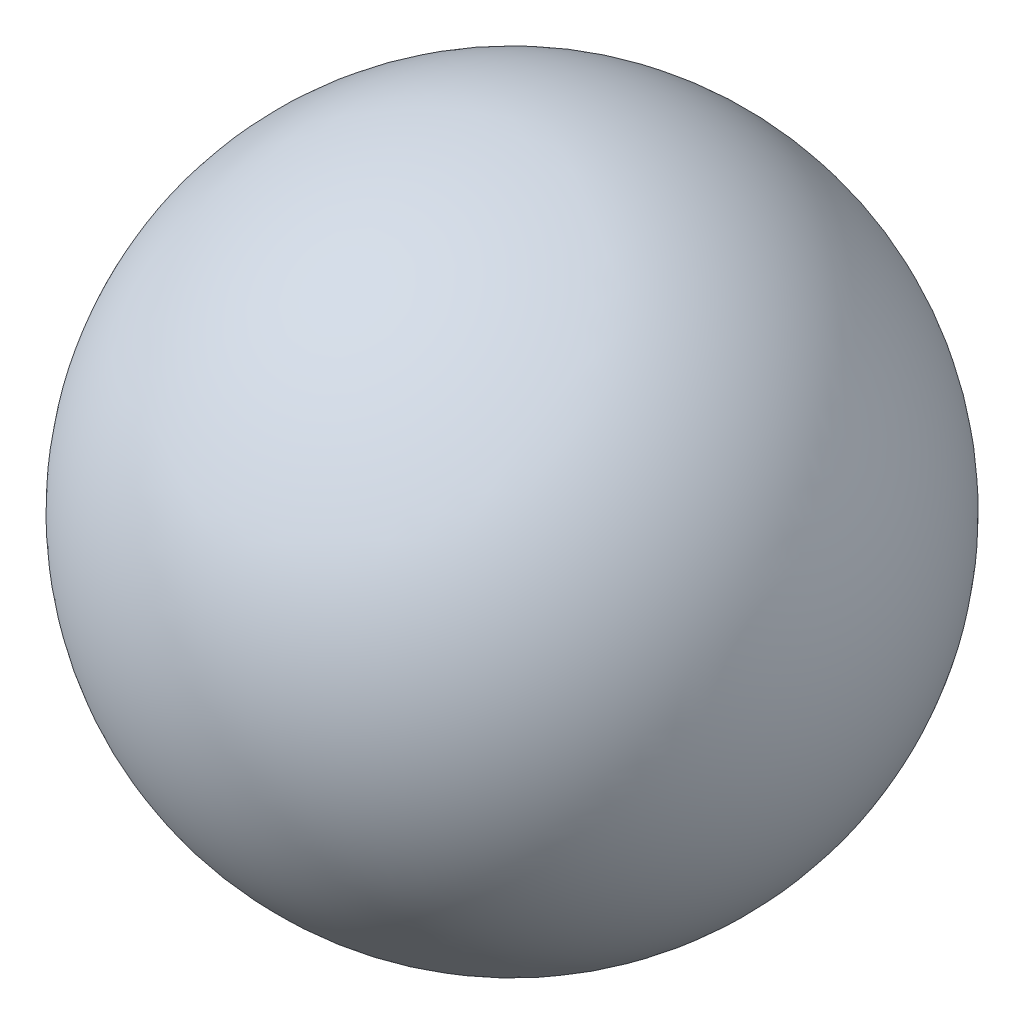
from build123d import *


with BuildPart() as part:
    # Sketch1 → Revolve1 (revolve)
    with BuildSketch(Plane.XY):
        with BuildLine():
            Line((0, 0), (25.4, 0))
            ThreePointArc((25.4, 0), (0, 25.4), (-25.4, 0))
            Line((-25.4, 0), (0, 0))
        make_face()
    revolve(axis=Axis((0, 0, 0), (-1, 0, 0)))


solid = part.part
